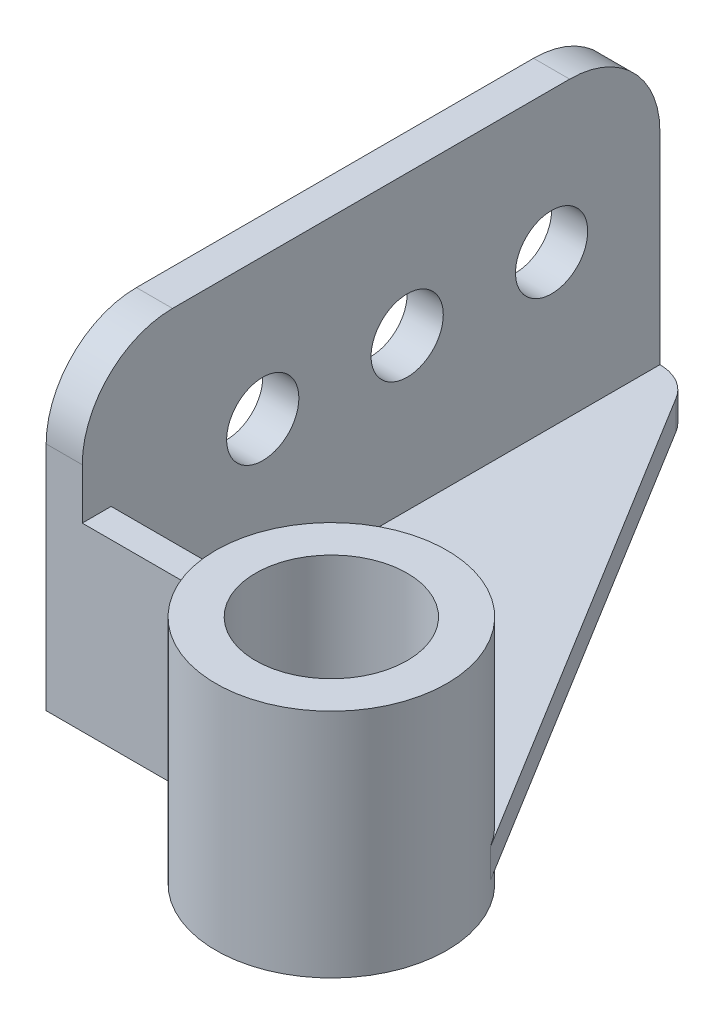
ISO-10303-21;
HEADER;
FILE_DESCRIPTION(('STEP AP214'),'2;1');
FILE_NAME('part.step','',(''),(''),'','','');
FILE_SCHEMA(('AUTOMOTIVE_DESIGN { 1 0 10303 214 1 1 1 1 }'));
ENDSEC;
DATA;
#1=APPLICATION_CONTEXT('core data for automotive mechanical design processes');
#2=APPLICATION_PROTOCOL_DEFINITION('international standard','automotive_design',2000,#1);
#3=PRODUCT_CONTEXT('',#1,'mechanical');
#4=PRODUCT('Part','Part','',(#3));
#5=PRODUCT_RELATED_PRODUCT_CATEGORY('part','',(#4));
#6=PRODUCT_DEFINITION_FORMATION('','',#4);
#7=PRODUCT_DEFINITION_CONTEXT('part definition',#1,'design');
#8=PRODUCT_DEFINITION('design','',#6,#7);
#9=PRODUCT_DEFINITION_SHAPE('','',#8);
#10=(LENGTH_UNIT() NAMED_UNIT(*) SI_UNIT(.MILLI.,.METRE.));
#11=(NAMED_UNIT(*) PLANE_ANGLE_UNIT() SI_UNIT($,.RADIAN.));
#12=(NAMED_UNIT(*) SI_UNIT($,.STERADIAN.) SOLID_ANGLE_UNIT());
#13=UNCERTAINTY_MEASURE_WITH_UNIT(LENGTH_MEASURE(1.E-05),#10,'distance_accuracy_value','');
#14=(GEOMETRIC_REPRESENTATION_CONTEXT(3) GLOBAL_UNCERTAINTY_ASSIGNED_CONTEXT((#13)) GLOBAL_UNIT_ASSIGNED_CONTEXT((#10,
#11,#12)) REPRESENTATION_CONTEXT('',''));
#15=CARTESIAN_POINT('',(0.,0.,0.));
#16=DIRECTION('',(0.,0.,1.));
#17=DIRECTION('',(1.,0.,0.));
#18=AXIS2_PLACEMENT_3D('',#15,#16,#17);
#19=CARTESIAN_POINT('',(10.,-25.,135.));
#20=DIRECTION('',(-1.,0.,0.));
#21=DIRECTION('',(0.,0.,1.));
#22=AXIS2_PLACEMENT_3D('',#19,#20,#21);
#23=PLANE('',#22);
#24=DIRECTION('',(0.,1.,0.));
#25=VECTOR('',#24,1.);
#26=CARTESIAN_POINT('',(10.,-81.,152.));
#27=LINE('',#26,#25);
#28=CARTESIAN_POINT('',(10.,-81.,152.));
#29=VERTEX_POINT('',#28);
#30=CARTESIAN_POINT('',(10.,-39.,152.));
#31=VERTEX_POINT('',#30);
#32=EDGE_CURVE('E138',#29,#31,#27,.T.);
#33=ORIENTED_EDGE('',*,*,#32,.F.);
#34=DIRECTION('',(0.,0.,-1.));
#35=VECTOR('',#34,1.);
#36=CARTESIAN_POINT('',(10.,-81.,160.));
#37=LINE('',#36,#35);
#38=CARTESIAN_POINT('',(10.,-81.,0.));
#39=VERTEX_POINT('',#38);
#40=EDGE_CURVE('E125',#29,#39,#37,.T.);
#41=ORIENTED_EDGE('',*,*,#40,.T.);
#42=DIRECTION('',(0.,-1.,0.));
#43=VECTOR('',#42,1.);
#44=CARTESIAN_POINT('',(10.,-25.,0.));
#45=LINE('',#44,#43);
#46=CARTESIAN_POINT('',(10.,-25.,0.));
#47=VERTEX_POINT('',#46);
#48=EDGE_CURVE('E198',#47,#39,#45,.T.);
#49=ORIENTED_EDGE('',*,*,#48,.F.);
#50=CARTESIAN_POINT('',(10.,-25.,25.));
#51=DIRECTION('',(-1.,0.,0.));
#52=DIRECTION('',(0.,0.,1.));
#53=AXIS2_PLACEMENT_3D('',#50,#51,#52);
#54=CIRCLE('',#53,25.);
#55=CARTESIAN_POINT('',(10.,0.,25.));
#56=VERTEX_POINT('',#55);
#57=EDGE_CURVE('E195',#56,#47,#54,.T.);
#58=ORIENTED_EDGE('',*,*,#57,.F.);
#59=DIRECTION('',(0.,0.,1.));
#60=VECTOR('',#59,1.);
#61=CARTESIAN_POINT('',(10.,0.,25.));
#62=LINE('',#61,#60);
#63=CARTESIAN_POINT('',(10.,0.,135.));
#64=VERTEX_POINT('',#63);
#65=EDGE_CURVE('E193',#56,#64,#62,.T.);
#66=ORIENTED_EDGE('',*,*,#65,.T.);
#67=CARTESIAN_POINT('',(10.,-25.,135.));
#68=DIRECTION('',(-1.,0.,0.));
#69=DIRECTION('',(0.,0.,1.));
#70=AXIS2_PLACEMENT_3D('',#67,#68,#69);
#71=CIRCLE('',#70,25.);
#72=CARTESIAN_POINT('',(10.,-25.,160.));
#73=VERTEX_POINT('',#72);
#74=EDGE_CURVE('E189',#73,#64,#71,.T.);
#75=ORIENTED_EDGE('',*,*,#74,.F.);
#76=DIRECTION('',(0.,1.,0.));
#77=VECTOR('',#76,1.);
#78=CARTESIAN_POINT('',(10.,-89.,160.));
#79=LINE('',#78,#77);
#80=CARTESIAN_POINT('',(10.,-39.,160.));
#81=VERTEX_POINT('',#80);
#82=EDGE_CURVE('E60',#81,#73,#79,.T.);
#83=ORIENTED_EDGE('',*,*,#82,.F.);
#84=DIRECTION('',(0.,0.,-1.));
#85=VECTOR('',#84,1.);
#86=CARTESIAN_POINT('',(10.,-39.,160.));
#87=LINE('',#86,#85);
#88=EDGE_CURVE('E55',#81,#31,#87,.T.);
#89=ORIENTED_EDGE('',*,*,#88,.T.);
#90=EDGE_LOOP('',(#33,#41,#49,#58,#66,#75,#83,#89));
#91=FACE_BOUND('',#90,.T.);
#92=CARTESIAN_POINT('',(10.,-39.,30.));
#93=DIRECTION('',(1.,0.,0.));
#94=DIRECTION('',(0.,0.,-1.));
#95=AXIS2_PLACEMENT_3D('',#92,#93,#94);
#96=CIRCLE('',#95,10.);
#97=CARTESIAN_POINT('',(10.,-39.,20.));
#98=VERTEX_POINT('',#97);
#99=EDGE_CURVE('E286',#98,#98,#96,.T.);
#100=ORIENTED_EDGE('',*,*,#99,.F.);
#101=EDGE_LOOP('',(#100));
#102=FACE_BOUND('',#101,.T.);
#103=CARTESIAN_POINT('',(10.,-39.,70.));
#104=DIRECTION('',(1.,0.,0.));
#105=DIRECTION('',(0.,0.,-1.));
#106=AXIS2_PLACEMENT_3D('',#103,#104,#105);
#107=CIRCLE('',#106,10.);
#108=CARTESIAN_POINT('',(10.,-39.,60.));
#109=VERTEX_POINT('',#108);
#110=EDGE_CURVE('E292',#109,#109,#107,.T.);
#111=ORIENTED_EDGE('',*,*,#110,.F.);
#112=EDGE_LOOP('',(#111));
#113=FACE_BOUND('',#112,.T.);
#114=CARTESIAN_POINT('',(10.,-39.,110.));
#115=DIRECTION('',(1.,0.,0.));
#116=DIRECTION('',(0.,0.,-1.));
#117=AXIS2_PLACEMENT_3D('',#114,#115,#116);
#118=CIRCLE('',#117,10.);
#119=CARTESIAN_POINT('',(10.,-39.,99.9999999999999));
#120=VERTEX_POINT('',#119);
#121=EDGE_CURVE('E48',#120,#120,#118,.T.);
#122=ORIENTED_EDGE('',*,*,#121,.F.);
#123=EDGE_LOOP('',(#122));
#124=FACE_BOUND('',#123,.T.);
#125=ADVANCED_FACE('F40',(#91,#102,#113,#124),#23,.F.);
#126=CARTESIAN_POINT('',(0.,-25.,135.));
#127=DIRECTION('',(-1.,0.,0.));
#128=DIRECTION('',(0.,0.,1.));
#129=AXIS2_PLACEMENT_3D('',#126,#127,#128);
#130=PLANE('',#129);
#131=CARTESIAN_POINT('',(0.,-39.,30.));
#132=DIRECTION('',(1.,0.,0.));
#133=DIRECTION('',(0.,0.,-1.));
#134=AXIS2_PLACEMENT_3D('',#131,#132,#133);
#135=CIRCLE('',#134,10.);
#136=CARTESIAN_POINT('',(0.,-39.,20.));
#137=VERTEX_POINT('',#136);
#138=EDGE_CURVE('E279',#137,#137,#135,.T.);
#139=ORIENTED_EDGE('',*,*,#138,.T.);
#140=EDGE_LOOP('',(#139));
#141=FACE_BOUND('',#140,.T.);
#142=DIRECTION('',(0.,1.,0.));
#143=VECTOR('',#142,1.);
#144=CARTESIAN_POINT('',(0.,-89.,160.));
#145=LINE('',#144,#143);
#146=CARTESIAN_POINT('',(0.,-89.,160.));
#147=VERTEX_POINT('',#146);
#148=CARTESIAN_POINT('',(0.,-25.,160.));
#149=VERTEX_POINT('',#148);
#150=EDGE_CURVE('E187',#147,#149,#145,.T.);
#151=ORIENTED_EDGE('',*,*,#150,.T.);
#152=CARTESIAN_POINT('',(0.,-25.,135.));
#153=DIRECTION('',(-1.,0.,0.));
#154=DIRECTION('',(0.,0.,1.));
#155=AXIS2_PLACEMENT_3D('',#152,#153,#154);
#156=CIRCLE('',#155,25.);
#157=CARTESIAN_POINT('',(0.,0.,135.));
#158=VERTEX_POINT('',#157);
#159=EDGE_CURVE('E204',#149,#158,#156,.T.);
#160=ORIENTED_EDGE('',*,*,#159,.T.);
#161=DIRECTION('',(0.,0.,1.));
#162=VECTOR('',#161,1.);
#163=CARTESIAN_POINT('',(0.,0.,25.));
#164=LINE('',#163,#162);
#165=CARTESIAN_POINT('',(0.,0.,25.));
#166=VERTEX_POINT('',#165);
#167=EDGE_CURVE('E207',#166,#158,#164,.T.);
#168=ORIENTED_EDGE('',*,*,#167,.F.);
#169=CARTESIAN_POINT('',(0.,-25.,25.));
#170=DIRECTION('',(-1.,0.,0.));
#171=DIRECTION('',(0.,0.,1.));
#172=AXIS2_PLACEMENT_3D('',#169,#170,#171);
#173=CIRCLE('',#172,25.);
#174=CARTESIAN_POINT('',(0.,-25.,0.));
#175=VERTEX_POINT('',#174);
#176=EDGE_CURVE('E210',#166,#175,#173,.T.);
#177=ORIENTED_EDGE('',*,*,#176,.T.);
#178=DIRECTION('',(0.,-1.,0.));
#179=VECTOR('',#178,1.);
#180=CARTESIAN_POINT('',(0.,-25.,0.));
#181=LINE('',#180,#179);
#182=CARTESIAN_POINT('',(0.,-89.,0.));
#183=VERTEX_POINT('',#182);
#184=EDGE_CURVE('E213',#175,#183,#181,.T.);
#185=ORIENTED_EDGE('',*,*,#184,.T.);
#186=DIRECTION('',(0.,0.,-1.));
#187=VECTOR('',#186,1.);
#188=CARTESIAN_POINT('',(0.,-89.,160.));
#189=LINE('',#188,#187);
#190=EDGE_CURVE('E190',#147,#183,#189,.T.);
#191=ORIENTED_EDGE('',*,*,#190,.F.);
#192=EDGE_LOOP('',(#151,#160,#168,#177,#185,#191));
#193=FACE_BOUND('',#192,.T.);
#194=CARTESIAN_POINT('',(0.,-39.,70.));
#195=DIRECTION('',(1.,0.,0.));
#196=DIRECTION('',(0.,0.,-1.));
#197=AXIS2_PLACEMENT_3D('',#194,#195,#196);
#198=CIRCLE('',#197,10.);
#199=CARTESIAN_POINT('',(0.,-39.,60.));
#200=VERTEX_POINT('',#199);
#201=EDGE_CURVE('E289',#200,#200,#198,.T.);
#202=ORIENTED_EDGE('',*,*,#201,.T.);
#203=EDGE_LOOP('',(#202));
#204=FACE_BOUND('',#203,.T.);
#205=CARTESIAN_POINT('',(0.,-39.,110.));
#206=DIRECTION('',(1.,0.,0.));
#207=DIRECTION('',(0.,0.,-1.));
#208=AXIS2_PLACEMENT_3D('',#205,#206,#207);
#209=CIRCLE('',#208,10.);
#210=CARTESIAN_POINT('',(0.,-39.,99.9999999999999));
#211=VERTEX_POINT('',#210);
#212=EDGE_CURVE('E11',#211,#211,#209,.T.);
#213=ORIENTED_EDGE('',*,*,#212,.T.);
#214=EDGE_LOOP('',(#213));
#215=FACE_BOUND('',#214,.T.);
#216=ADVANCED_FACE('F236',(#141,#193,#204,#215),#130,.T.);
#217=CARTESIAN_POINT('',(75.,-81.,156.));
#218=DIRECTION('',(0.,-1.,0.));
#219=DIRECTION('',(1.,0.,0.));
#220=AXIS2_PLACEMENT_3D('',#217,#218,#219);
#221=PLANE('',#220);
#222=DIRECTION('',(-1.,0.,0.));
#223=VECTOR('',#222,1.);
#224=CARTESIAN_POINT('',(107.001,-81.,152.));
#225=LINE('',#224,#223);
#226=CARTESIAN_POINT('',(43.2509842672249,-81.,152.));
#227=VERTEX_POINT('',#226);
#228=EDGE_CURVE('E128',#227,#29,#225,.T.);
#229=ORIENTED_EDGE('',*,*,#228,.F.);
#230=CARTESIAN_POINT('',(75.,-81.,156.));
#231=DIRECTION('',(0.,-1.,0.));
#232=DIRECTION('',(1.,0.,0.));
#233=AXIS2_PLACEMENT_3D('',#230,#231,#232);
#234=CIRCLE('',#233,32.);
#235=CARTESIAN_POINT('',(102.265070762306,-81.,139.248405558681));
#236=VERTEX_POINT('',#235);
#237=EDGE_CURVE('E220',#227,#236,#234,.T.);
#238=ORIENTED_EDGE('',*,*,#237,.T.);
#239=DIRECTION('',(0.523487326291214,0.,0.852033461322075));
#240=VECTOR('',#239,1.);
#241=CARTESIAN_POINT('',(20.224401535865,-81.,5.71815208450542));
#242=LINE('',#241,#240);
#243=CARTESIAN_POINT('',(20.2244015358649,-81.,5.71815208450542));
#244=VERTEX_POINT('',#243);
#245=EDGE_CURVE('E170',#244,#236,#242,.T.);
#246=ORIENTED_EDGE('',*,*,#245,.F.);
#247=CARTESIAN_POINT('',(10.,-81.,12.));
#248=DIRECTION('',(0.,-1.,0.));
#249=DIRECTION('',(1.,0.,0.));
#250=AXIS2_PLACEMENT_3D('',#247,#248,#249);
#251=CIRCLE('',#250,12.);
#252=EDGE_CURVE('E132',#39,#244,#251,.T.);
#253=ORIENTED_EDGE('',*,*,#252,.F.);
#254=ORIENTED_EDGE('',*,*,#40,.F.);
#255=EDGE_LOOP('',(#229,#238,#246,#253,#254));
#256=FACE_BOUND('',#255,.T.);
#257=ADVANCED_FACE('F126',(#256),#221,.F.);
#258=CARTESIAN_POINT('',(10.,-89.,160.));
#259=DIRECTION('',(0.,0.,1.));
#260=DIRECTION('',(1.,0.,0.));
#261=AXIS2_PLACEMENT_3D('',#258,#259,#260);
#262=PLANE('',#261);
#263=DIRECTION('',(-1.,0.,0.));
#264=VECTOR('',#263,1.);
#265=CARTESIAN_POINT('',(107.001,-39.,160.));
#266=LINE('',#265,#264);
#267=CARTESIAN_POINT('',(43.2509842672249,-39.,160.));
#268=VERTEX_POINT('',#267);
#269=EDGE_CURVE('E148',#268,#81,#266,.T.);
#270=ORIENTED_EDGE('',*,*,#269,.T.);
#271=ORIENTED_EDGE('',*,*,#82,.T.);
#272=DIRECTION('',(-1.,0.,0.));
#273=VECTOR('',#272,1.);
#274=CARTESIAN_POINT('',(10.,-25.,160.));
#275=LINE('',#274,#273);
#276=EDGE_CURVE('E201',#73,#149,#275,.T.);
#277=ORIENTED_EDGE('',*,*,#276,.T.);
#278=ORIENTED_EDGE('',*,*,#150,.F.);
#279=DIRECTION('',(-1.,0.,0.));
#280=VECTOR('',#279,1.);
#281=CARTESIAN_POINT('',(10.,-89.,160.));
#282=LINE('',#281,#280);
#283=CARTESIAN_POINT('',(43.2509842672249,-89.,160.));
#284=VERTEX_POINT('',#283);
#285=EDGE_CURVE('E218',#284,#147,#282,.T.);
#286=ORIENTED_EDGE('',*,*,#285,.F.);
#287=DIRECTION('',(0.,-1.,0.));
#288=VECTOR('',#287,1.);
#289=CARTESIAN_POINT('',(43.2509842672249,-81.,160.));
#290=LINE('',#289,#288);
#291=EDGE_CURVE('E185',#268,#284,#290,.T.);
#292=ORIENTED_EDGE('',*,*,#291,.F.);
#293=EDGE_LOOP('',(#270,#271,#277,#278,#286,#292));
#294=FACE_BOUND('',#293,.T.);
#295=ADVANCED_FACE('F251',(#294),#262,.T.);
#296=CARTESIAN_POINT('',(10.,-89.,160.));
#297=DIRECTION('',(0.,1.,0.));
#298=DIRECTION('',(0.,0.,1.));
#299=AXIS2_PLACEMENT_3D('',#296,#297,#298);
#300=PLANE('',#299);
#301=DIRECTION('',(0.523487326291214,0.,0.852033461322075));
#302=VECTOR('',#301,1.);
#303=CARTESIAN_POINT('',(20.224401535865,-89.,5.71815208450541));
#304=LINE('',#303,#302);
#305=CARTESIAN_POINT('',(20.2244015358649,-89.,5.71815208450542));
#306=VERTEX_POINT('',#305);
#307=CARTESIAN_POINT('',(102.265070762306,-89.,139.248405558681));
#308=VERTEX_POINT('',#307);
#309=EDGE_CURVE('E169',#306,#308,#304,.T.);
#310=ORIENTED_EDGE('',*,*,#309,.T.);
#311=CARTESIAN_POINT('',(75.,-89.,156.));
#312=DIRECTION('',(0.,1.,0.));
#313=DIRECTION('',(0.,0.,1.));
#314=AXIS2_PLACEMENT_3D('',#311,#312,#313);
#315=CIRCLE('',#314,32.);
#316=EDGE_CURVE('E164',#308,#284,#315,.T.);
#317=ORIENTED_EDGE('',*,*,#316,.T.);
#318=ORIENTED_EDGE('',*,*,#285,.T.);
#319=ORIENTED_EDGE('',*,*,#190,.T.);
#320=DIRECTION('',(-1.,0.,0.));
#321=VECTOR('',#320,1.);
#322=CARTESIAN_POINT('',(10.,-89.,0.));
#323=LINE('',#322,#321);
#324=CARTESIAN_POINT('',(10.,-89.,0.));
#325=VERTEX_POINT('',#324);
#326=EDGE_CURVE('E221',#325,#183,#323,.T.);
#327=ORIENTED_EDGE('',*,*,#326,.F.);
#328=CARTESIAN_POINT('',(10.,-89.,12.));
#329=DIRECTION('',(0.,-1.,0.));
#330=DIRECTION('',(1.,0.,0.));
#331=AXIS2_PLACEMENT_3D('',#328,#329,#330);
#332=CIRCLE('',#331,12.);
#333=EDGE_CURVE('E173',#325,#306,#332,.T.);
#334=ORIENTED_EDGE('',*,*,#333,.T.);
#335=EDGE_LOOP('',(#310,#317,#318,#319,#327,#334));
#336=FACE_BOUND('',#335,.T.);
#337=ADVANCED_FACE('F247',(#336),#300,.F.);
#338=CARTESIAN_POINT('',(10.,-25.,0.));
#339=DIRECTION('',(0.,0.,-1.));
#340=DIRECTION('',(-1.,0.,0.));
#341=AXIS2_PLACEMENT_3D('',#338,#339,#340);
#342=PLANE('',#341);
#343=ORIENTED_EDGE('',*,*,#184,.F.);
#344=DIRECTION('',(-1.,0.,0.));
#345=VECTOR('',#344,1.);
#346=CARTESIAN_POINT('',(10.,-25.,0.));
#347=LINE('',#346,#345);
#348=EDGE_CURVE('E223',#47,#175,#347,.T.);
#349=ORIENTED_EDGE('',*,*,#348,.F.);
#350=ORIENTED_EDGE('',*,*,#48,.T.);
#351=DIRECTION('',(0.,-1.,0.));
#352=VECTOR('',#351,1.);
#353=CARTESIAN_POINT('',(10.,-81.,0.));
#354=LINE('',#353,#352);
#355=EDGE_CURVE('E135',#39,#325,#354,.T.);
#356=ORIENTED_EDGE('',*,*,#355,.T.);
#357=ORIENTED_EDGE('',*,*,#326,.T.);
#358=EDGE_LOOP('',(#343,#349,#350,#356,#357));
#359=FACE_BOUND('',#358,.T.);
#360=ADVANCED_FACE('F250',(#359),#342,.T.);
#361=CARTESIAN_POINT('',(10.,-25.,25.));
#362=DIRECTION('',(-1.,0.,0.));
#363=DIRECTION('',(0.,0.,1.));
#364=AXIS2_PLACEMENT_3D('',#361,#362,#363);
#365=CYLINDRICAL_SURFACE('',#364,25.);
#366=ORIENTED_EDGE('',*,*,#176,.F.);
#367=DIRECTION('',(-1.,0.,0.));
#368=VECTOR('',#367,1.);
#369=CARTESIAN_POINT('',(10.,0.,25.));
#370=LINE('',#369,#368);
#371=EDGE_CURVE('E225',#56,#166,#370,.T.);
#372=ORIENTED_EDGE('',*,*,#371,.F.);
#373=ORIENTED_EDGE('',*,*,#57,.T.);
#374=ORIENTED_EDGE('',*,*,#348,.T.);
#375=EDGE_LOOP('',(#366,#372,#373,#374));
#376=FACE_BOUND('',#375,.T.);
#377=ADVANCED_FACE('F255',(#376),#365,.T.);
#378=CARTESIAN_POINT('',(10.,0.,25.));
#379=DIRECTION('',(0.,-1.,0.));
#380=DIRECTION('',(0.,0.,-1.));
#381=AXIS2_PLACEMENT_3D('',#378,#379,#380);
#382=PLANE('',#381);
#383=ORIENTED_EDGE('',*,*,#167,.T.);
#384=DIRECTION('',(-1.,0.,0.));
#385=VECTOR('',#384,1.);
#386=CARTESIAN_POINT('',(10.,0.,135.));
#387=LINE('',#386,#385);
#388=EDGE_CURVE('E227',#64,#158,#387,.T.);
#389=ORIENTED_EDGE('',*,*,#388,.F.);
#390=ORIENTED_EDGE('',*,*,#65,.F.);
#391=ORIENTED_EDGE('',*,*,#371,.T.);
#392=EDGE_LOOP('',(#383,#389,#390,#391));
#393=FACE_BOUND('',#392,.T.);
#394=ADVANCED_FACE('F259',(#393),#382,.F.);
#395=CARTESIAN_POINT('',(10.,-25.,135.));
#396=DIRECTION('',(-1.,0.,0.));
#397=DIRECTION('',(0.,0.,1.));
#398=AXIS2_PLACEMENT_3D('',#395,#396,#397);
#399=CYLINDRICAL_SURFACE('',#398,25.);
#400=ORIENTED_EDGE('',*,*,#159,.F.);
#401=ORIENTED_EDGE('',*,*,#276,.F.);
#402=ORIENTED_EDGE('',*,*,#74,.T.);
#403=ORIENTED_EDGE('',*,*,#388,.T.);
#404=EDGE_LOOP('',(#400,#401,#402,#403));
#405=FACE_BOUND('',#404,.T.);
#406=ADVANCED_FACE('F263',(#405),#399,.T.);
#407=CARTESIAN_POINT('',(75.,-81.,156.));
#408=DIRECTION('',(0.,-1.,0.));
#409=DIRECTION('',(1.,0.,0.));
#410=AXIS2_PLACEMENT_3D('',#407,#408,#409);
#411=CYLINDRICAL_SURFACE('',#410,32.);
#412=CARTESIAN_POINT('',(75.,-39.,156.));
#413=DIRECTION('',(0.,1.,0.));
#414=DIRECTION('',(-1.,0.,0.));
#415=AXIS2_PLACEMENT_3D('',#412,#413,#414);
#416=CIRCLE('',#415,32.);
#417=CARTESIAN_POINT('',(43.2509842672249,-39.,152.));
#418=VERTEX_POINT('',#417);
#419=EDGE_CURVE('E157',#418,#268,#416,.T.);
#420=ORIENTED_EDGE('',*,*,#419,.T.);
#421=ORIENTED_EDGE('',*,*,#291,.T.);
#422=ORIENTED_EDGE('',*,*,#316,.F.);
#423=DIRECTION('',(0.,-1.,0.));
#424=VECTOR('',#423,1.);
#425=CARTESIAN_POINT('',(102.265070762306,-81.,139.248405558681));
#426=LINE('',#425,#424);
#427=EDGE_CURVE('E183',#236,#308,#426,.T.);
#428=ORIENTED_EDGE('',*,*,#427,.F.);
#429=ORIENTED_EDGE('',*,*,#237,.F.);
#430=DIRECTION('',(0.,-1.,0.));
#431=VECTOR('',#430,1.);
#432=CARTESIAN_POINT('',(43.2509842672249,-81.,152.));
#433=LINE('',#432,#431);
#434=EDGE_CURVE('E146',#418,#227,#433,.T.);
#435=ORIENTED_EDGE('',*,*,#434,.F.);
#436=EDGE_LOOP('',(#420,#421,#422,#428,#429,#435));
#437=FACE_BOUND('',#436,.T.);
#438=CARTESIAN_POINT('',(75.,-31.,156.));
#439=DIRECTION('',(0.,-1.,0.));
#440=DIRECTION('',(1.,0.,0.));
#441=AXIS2_PLACEMENT_3D('',#438,#439,#440);
#442=CIRCLE('',#441,32.);
#443=CARTESIAN_POINT('',(107.,-31.,156.));
#444=VERTEX_POINT('',#443);
#445=EDGE_CURVE('E161',#444,#444,#442,.T.);
#446=ORIENTED_EDGE('',*,*,#445,.T.);
#447=EDGE_LOOP('',(#446));
#448=FACE_BOUND('',#447,.T.);
#449=CARTESIAN_POINT('',(75.,-95.,156.));
#450=DIRECTION('',(0.,-1.,0.));
#451=DIRECTION('',(1.,0.,0.));
#452=AXIS2_PLACEMENT_3D('',#449,#450,#451);
#453=CIRCLE('',#452,32.);
#454=CARTESIAN_POINT('',(107.,-95.,156.));
#455=VERTEX_POINT('',#454);
#456=EDGE_CURVE('E160',#455,#455,#453,.T.);
#457=ORIENTED_EDGE('',*,*,#456,.F.);
#458=EDGE_LOOP('',(#457));
#459=FACE_BOUND('',#458,.T.);
#460=ADVANCED_FACE('F244',(#437,#448,#459),#411,.T.);
#461=CARTESIAN_POINT('',(20.224401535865,-81.,5.71815208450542));
#462=DIRECTION('',(0.852033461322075,0.,-0.523487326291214));
#463=DIRECTION('',(-0.523487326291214,0.,-0.852033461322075));
#464=AXIS2_PLACEMENT_3D('',#461,#462,#463);
#465=PLANE('',#464);
#466=ORIENTED_EDGE('',*,*,#309,.F.);
#467=DIRECTION('',(0.,-1.,0.));
#468=VECTOR('',#467,1.);
#469=CARTESIAN_POINT('',(20.2244015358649,-81.,5.71815208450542));
#470=LINE('',#469,#468);
#471=EDGE_CURVE('E181',#244,#306,#470,.T.);
#472=ORIENTED_EDGE('',*,*,#471,.F.);
#473=ORIENTED_EDGE('',*,*,#245,.T.);
#474=ORIENTED_EDGE('',*,*,#427,.T.);
#475=EDGE_LOOP('',(#466,#472,#473,#474));
#476=FACE_BOUND('',#475,.T.);
#477=ADVANCED_FACE('F367',(#476),#465,.T.);
#478=CARTESIAN_POINT('',(10.,-81.,12.));
#479=DIRECTION('',(0.,-1.,0.));
#480=DIRECTION('',(1.,0.,0.));
#481=AXIS2_PLACEMENT_3D('',#478,#479,#480);
#482=CYLINDRICAL_SURFACE('',#481,12.);
#483=ORIENTED_EDGE('',*,*,#333,.F.);
#484=ORIENTED_EDGE('',*,*,#355,.F.);
#485=ORIENTED_EDGE('',*,*,#252,.T.);
#486=ORIENTED_EDGE('',*,*,#471,.T.);
#487=EDGE_LOOP('',(#483,#484,#485,#486));
#488=FACE_BOUND('',#487,.T.);
#489=ADVANCED_FACE('F358',(#488),#482,.T.);
#490=CARTESIAN_POINT('',(75.,-31.,156.));
#491=DIRECTION('',(0.,-1.,0.));
#492=DIRECTION('',(1.,0.,0.));
#493=AXIS2_PLACEMENT_3D('',#490,#491,#492);
#494=PLANE('',#493);
#495=CARTESIAN_POINT('',(75.,-31.,156.));
#496=DIRECTION('',(0.,-1.,0.));
#497=DIRECTION('',(1.,0.,0.));
#498=AXIS2_PLACEMENT_3D('',#495,#496,#497);
#499=CIRCLE('',#498,21.);
#500=CARTESIAN_POINT('',(96.,-31.,156.));
#501=VERTEX_POINT('',#500);
#502=EDGE_CURVE('E156',#501,#501,#499,.T.);
#503=ORIENTED_EDGE('',*,*,#502,.T.);
#504=EDGE_LOOP('',(#503));
#505=FACE_BOUND('',#504,.T.);
#506=ORIENTED_EDGE('',*,*,#445,.F.);
#507=EDGE_LOOP('',(#506));
#508=FACE_BOUND('',#507,.T.);
#509=ADVANCED_FACE('F350',(#505,#508),#494,.F.);
#510=CARTESIAN_POINT('',(75.,-95.,156.));
#511=DIRECTION('',(0.,-1.,0.));
#512=DIRECTION('',(1.,0.,0.));
#513=AXIS2_PLACEMENT_3D('',#510,#511,#512);
#514=PLANE('',#513);
#515=CARTESIAN_POINT('',(75.,-95.,156.));
#516=DIRECTION('',(0.,-1.,0.));
#517=DIRECTION('',(1.,0.,0.));
#518=AXIS2_PLACEMENT_3D('',#515,#516,#517);
#519=CIRCLE('',#518,21.);
#520=CARTESIAN_POINT('',(96.,-95.,156.));
#521=VERTEX_POINT('',#520);
#522=EDGE_CURVE('E153',#521,#521,#519,.T.);
#523=ORIENTED_EDGE('',*,*,#522,.F.);
#524=EDGE_LOOP('',(#523));
#525=FACE_BOUND('',#524,.T.);
#526=ORIENTED_EDGE('',*,*,#456,.T.);
#527=EDGE_LOOP('',(#526));
#528=FACE_BOUND('',#527,.T.);
#529=ADVANCED_FACE('F341',(#525,#528),#514,.T.);
#530=CARTESIAN_POINT('',(75.,0.,156.));
#531=DIRECTION('',(0.,-1.,0.));
#532=DIRECTION('',(1.,0.,0.));
#533=AXIS2_PLACEMENT_3D('',#530,#531,#532);
#534=CYLINDRICAL_SURFACE('',#533,21.);
#535=ORIENTED_EDGE('',*,*,#522,.T.);
#536=EDGE_LOOP('',(#535));
#537=FACE_BOUND('',#536,.T.);
#538=ORIENTED_EDGE('',*,*,#502,.F.);
#539=EDGE_LOOP('',(#538));
#540=FACE_BOUND('',#539,.T.);
#541=ADVANCED_FACE('F333',(#537,#540),#534,.F.);
#542=CARTESIAN_POINT('',(107.001,-81.,152.));
#543=DIRECTION('',(0.,0.,1.));
#544=DIRECTION('',(1.,0.,0.));
#545=AXIS2_PLACEMENT_3D('',#542,#543,#544);
#546=PLANE('',#545);
#547=DIRECTION('',(-1.,0.,0.));
#548=VECTOR('',#547,1.);
#549=CARTESIAN_POINT('',(107.001,-39.,152.));
#550=LINE('',#549,#548);
#551=EDGE_CURVE('E142',#418,#31,#550,.T.);
#552=ORIENTED_EDGE('',*,*,#551,.F.);
#553=ORIENTED_EDGE('',*,*,#434,.T.);
#554=ORIENTED_EDGE('',*,*,#228,.T.);
#555=ORIENTED_EDGE('',*,*,#32,.T.);
#556=EDGE_LOOP('',(#552,#553,#554,#555));
#557=FACE_BOUND('',#556,.T.);
#558=ADVANCED_FACE('F145',(#557),#546,.F.);
#559=CARTESIAN_POINT('',(107.001,-39.,160.));
#560=DIRECTION('',(0.,1.,0.));
#561=DIRECTION('',(-1.,0.,0.));
#562=AXIS2_PLACEMENT_3D('',#559,#560,#561);
#563=PLANE('',#562);
#564=ORIENTED_EDGE('',*,*,#419,.F.);
#565=ORIENTED_EDGE('',*,*,#551,.T.);
#566=ORIENTED_EDGE('',*,*,#88,.F.);
#567=ORIENTED_EDGE('',*,*,#269,.F.);
#568=EDGE_LOOP('',(#564,#565,#566,#567));
#569=FACE_BOUND('',#568,.T.);
#570=ADVANCED_FACE('F280',(#569),#563,.T.);
#571=CARTESIAN_POINT('',(10.,-39.,30.));
#572=DIRECTION('',(1.,0.,0.));
#573=DIRECTION('',(0.,0.,-1.));
#574=AXIS2_PLACEMENT_3D('',#571,#572,#573);
#575=CYLINDRICAL_SURFACE('',#574,10.);
#576=ORIENTED_EDGE('',*,*,#99,.T.);
#577=EDGE_LOOP('',(#576));
#578=FACE_BOUND('',#577,.T.);
#579=ORIENTED_EDGE('',*,*,#138,.F.);
#580=EDGE_LOOP('',(#579));
#581=FACE_BOUND('',#580,.T.);
#582=ADVANCED_FACE('F300',(#578,#581),#575,.F.);
#583=CARTESIAN_POINT('',(10.,-39.,70.));
#584=DIRECTION('',(1.,0.,0.));
#585=DIRECTION('',(0.,0.,-1.));
#586=AXIS2_PLACEMENT_3D('',#583,#584,#585);
#587=CYLINDRICAL_SURFACE('',#586,10.);
#588=ORIENTED_EDGE('',*,*,#110,.T.);
#589=EDGE_LOOP('',(#588));
#590=FACE_BOUND('',#589,.T.);
#591=ORIENTED_EDGE('',*,*,#201,.F.);
#592=EDGE_LOOP('',(#591));
#593=FACE_BOUND('',#592,.T.);
#594=ADVANCED_FACE('F296',(#590,#593),#587,.F.);
#595=CARTESIAN_POINT('',(10.,-39.,110.));
#596=DIRECTION('',(1.,0.,0.));
#597=DIRECTION('',(0.,0.,-1.));
#598=AXIS2_PLACEMENT_3D('',#595,#596,#597);
#599=CYLINDRICAL_SURFACE('',#598,10.);
#600=ORIENTED_EDGE('',*,*,#121,.T.);
#601=EDGE_LOOP('',(#600));
#602=FACE_BOUND('',#601,.T.);
#603=ORIENTED_EDGE('',*,*,#212,.F.);
#604=EDGE_LOOP('',(#603));
#605=FACE_BOUND('',#604,.T.);
#606=ADVANCED_FACE('F42',(#602,#605),#599,.F.);
#607=CLOSED_SHELL('',(#125,#216,#257,#295,#337,#360,#377,#394,#406,#460,#477,#489,#509,#529,
#541,#558,#570,#582,#594,#606));
#608=MANIFOLD_SOLID_BREP('B2',#607);
#609=ADVANCED_BREP_SHAPE_REPRESENTATION('',(#18,#608),#14);
#610=SHAPE_DEFINITION_REPRESENTATION(#9,#609);
ENDSEC;
END-ISO-10303-21;
